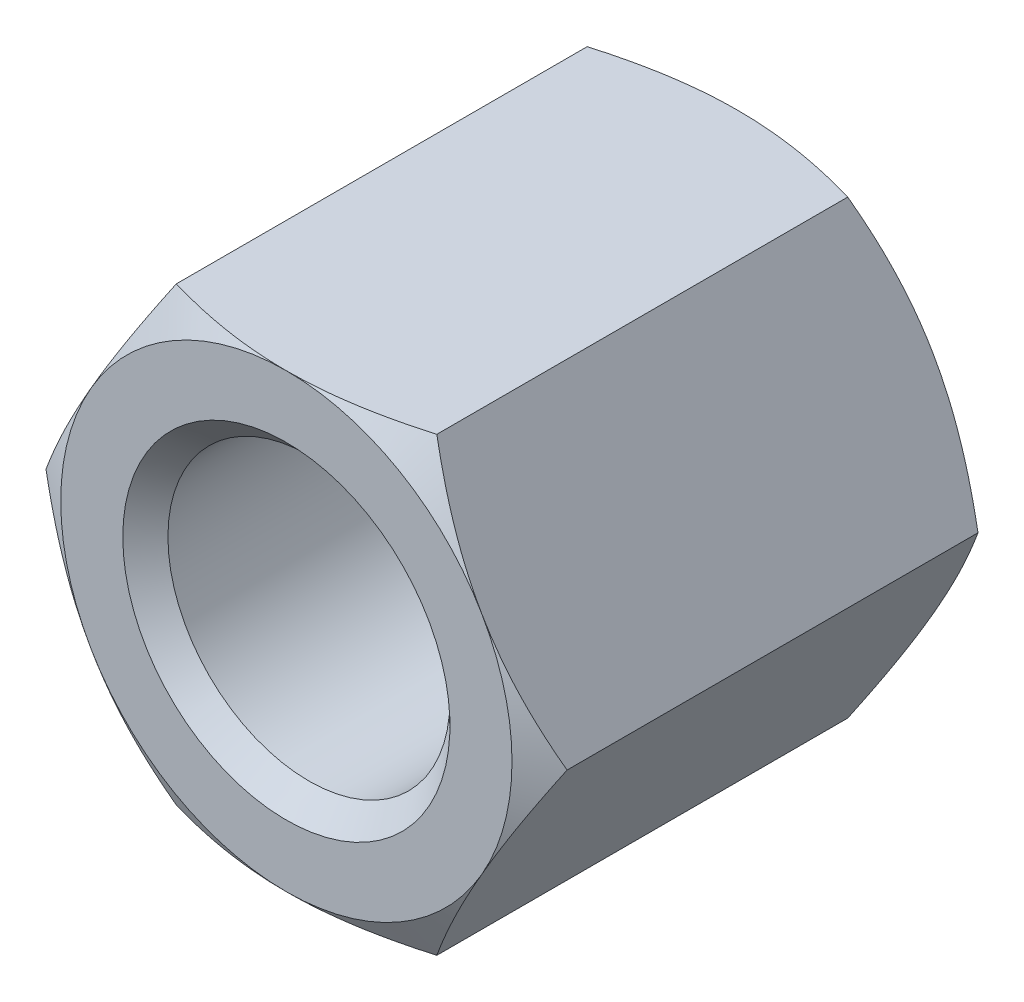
ISO-10303-21;
HEADER;
FILE_DESCRIPTION(('STEP AP214'),'2;1');
FILE_NAME('part.step','',(''),(''),'','','');
FILE_SCHEMA(('AUTOMOTIVE_DESIGN { 1 0 10303 214 1 1 1 1 }'));
ENDSEC;
DATA;
#1=APPLICATION_CONTEXT('core data for automotive mechanical design processes');
#2=APPLICATION_PROTOCOL_DEFINITION('international standard','automotive_design',2000,#1);
#3=PRODUCT_CONTEXT('',#1,'mechanical');
#4=PRODUCT('Part','Part','',(#3));
#5=PRODUCT_RELATED_PRODUCT_CATEGORY('part','',(#4));
#6=PRODUCT_DEFINITION_FORMATION('','',#4);
#7=PRODUCT_DEFINITION_CONTEXT('part definition',#1,'design');
#8=PRODUCT_DEFINITION('design','',#6,#7);
#9=PRODUCT_DEFINITION_SHAPE('','',#8);
#10=(LENGTH_UNIT() NAMED_UNIT(*) SI_UNIT(.MILLI.,.METRE.));
#11=(NAMED_UNIT(*) PLANE_ANGLE_UNIT() SI_UNIT($,.RADIAN.));
#12=(NAMED_UNIT(*) SI_UNIT($,.STERADIAN.) SOLID_ANGLE_UNIT());
#13=UNCERTAINTY_MEASURE_WITH_UNIT(LENGTH_MEASURE(1.E-05),#10,'distance_accuracy_value','');
#14=(GEOMETRIC_REPRESENTATION_CONTEXT(3) GLOBAL_UNCERTAINTY_ASSIGNED_CONTEXT((#13)) GLOBAL_UNIT_ASSIGNED_CONTEXT((#10,
#11,#12)) REPRESENTATION_CONTEXT('',''));
#15=CARTESIAN_POINT('',(0.,0.,0.));
#16=DIRECTION('',(0.,0.,1.));
#17=DIRECTION('',(1.,0.,0.));
#18=AXIS2_PLACEMENT_3D('',#15,#16,#17);
#19=CARTESIAN_POINT('',(4.61880215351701,0.,-4.));
#20=DIRECTION('',(0.866025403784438,0.5,0.));
#21=DIRECTION('',(-0.5,0.866025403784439,0.));
#22=AXIS2_PLACEMENT_3D('',#19,#20,#21);
#23=PLANE('',#22);
#24=CARTESIAN_POINT('',(4.61891762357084,-0.000199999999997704,3.64266774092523));
#25=CARTESIAN_POINT('',(4.51743148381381,0.17557915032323,3.70128212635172));
#26=CARTESIAN_POINT('',(4.41506932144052,0.352875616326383,3.75458967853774));
#27=CARTESIAN_POINT('',(4.20857250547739,0.710538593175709,3.8476383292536));
#28=CARTESIAN_POINT('',(4.10443418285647,0.890911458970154,3.8873465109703));
#29=CARTESIAN_POINT('',(3.89744813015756,1.24942181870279,3.94915778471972));
#30=CARTESIAN_POINT('',(3.79463224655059,1.42750415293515,3.97167226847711));
#31=CARTESIAN_POINT('',(3.58851671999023,1.78450671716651,3.99854937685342));
#32=CARTESIAN_POINT('',(3.48521782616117,1.9634256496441,4.00293425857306));
#33=CARTESIAN_POINT('',(3.29219970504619,2.29774284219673,3.99380992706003));
#34=CARTESIAN_POINT('',(3.20245157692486,2.45319115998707,3.98254104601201));
#35=CARTESIAN_POINT('',(3.02354002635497,2.76307505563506,3.94682600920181));
#36=CARTESIAN_POINT('',(2.93437722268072,2.91750956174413,3.92236765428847));
#37=CARTESIAN_POINT('',(2.75509682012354,3.22803232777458,3.86122393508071));
#38=CARTESIAN_POINT('',(2.6650019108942,3.3840812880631,3.82427939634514));
#39=CARTESIAN_POINT('',(2.48615580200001,3.69385183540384,3.74042992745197));
#40=CARTESIAN_POINT('',(2.39740231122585,3.84757739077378,3.69354469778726));
#41=CARTESIAN_POINT('',(2.30928560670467,4.0002,3.64266774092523));
#42=B_SPLINE_CURVE_WITH_KNOTS('',3,(#24,#25,#26,#27,#28,#29,#30,#31,#32,#33,#34,#35,#36,#37,#38,
#39,#40,#41),.UNSPECIFIED.,.F.,.F.,(4,2,2,2,2,2,2,2,4),(0.,0.634047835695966,1.26961969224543,
1.88946157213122,2.50854226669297,3.04757825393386,3.58711366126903,4.13861653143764,
4.68903648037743),.UNSPECIFIED.);
#43=CARTESIAN_POINT('',(4.61880215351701,0.,3.64273441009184));
#44=VERTEX_POINT('',#43);
#45=CARTESIAN_POINT('',(3.46410161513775,2.,4.));
#46=VERTEX_POINT('',#45);
#47=EDGE_CURVE('E127',#44,#46,#42,.T.);
#48=ORIENTED_EDGE('',*,*,#47,.F.);
#49=DIRECTION('',(0.,0.,1.));
#50=VECTOR('',#49,1.);
#51=CARTESIAN_POINT('',(4.61880215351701,0.,-4.));
#52=LINE('',#51,#50);
#53=CARTESIAN_POINT('',(4.61880215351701,0.,-3.64273441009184));
#54=VERTEX_POINT('',#53);
#55=EDGE_CURVE('E536',#54,#44,#52,.T.);
#56=ORIENTED_EDGE('',*,*,#55,.F.);
#57=CARTESIAN_POINT('',(4.61891762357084,-0.000199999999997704,-3.64266774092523));
#58=CARTESIAN_POINT('',(4.51743148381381,0.17557915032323,-3.70128212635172));
#59=CARTESIAN_POINT('',(4.41506932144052,0.352875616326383,-3.75458967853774));
#60=CARTESIAN_POINT('',(4.20857250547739,0.710538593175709,-3.8476383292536));
#61=CARTESIAN_POINT('',(4.10443418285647,0.890911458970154,-3.8873465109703));
#62=CARTESIAN_POINT('',(3.89744813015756,1.24942181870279,-3.94915778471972));
#63=CARTESIAN_POINT('',(3.79463224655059,1.42750415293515,-3.97167226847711));
#64=CARTESIAN_POINT('',(3.58851671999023,1.78450671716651,-3.99854937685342));
#65=CARTESIAN_POINT('',(3.48521782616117,1.9634256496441,-4.00293425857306));
#66=CARTESIAN_POINT('',(3.29219970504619,2.29774284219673,-3.99380992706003));
#67=CARTESIAN_POINT('',(3.20245157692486,2.45319115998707,-3.98254104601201));
#68=CARTESIAN_POINT('',(3.02354002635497,2.76307505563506,-3.94682600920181));
#69=CARTESIAN_POINT('',(2.93437722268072,2.91750956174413,-3.92236765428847));
#70=CARTESIAN_POINT('',(2.75509682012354,3.22803232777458,-3.86122393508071));
#71=CARTESIAN_POINT('',(2.6650019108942,3.3840812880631,-3.82427939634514));
#72=CARTESIAN_POINT('',(2.48615580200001,3.69385183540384,-3.74042992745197));
#73=CARTESIAN_POINT('',(2.39740231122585,3.84757739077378,-3.69354469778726));
#74=CARTESIAN_POINT('',(2.30928560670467,4.0002,-3.64266774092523));
#75=B_SPLINE_CURVE_WITH_KNOTS('',3,(#57,#58,#59,#60,#61,#62,#63,#64,#65,#66,#67,#68,#69,#70,#71,
#72,#73,#74),.UNSPECIFIED.,.F.,.F.,(4,2,2,2,2,2,2,2,4),(0.,0.634047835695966,1.26961969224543,
1.88946157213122,2.50854226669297,3.04757825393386,3.58711366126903,4.13861653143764,
4.68903648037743),.UNSPECIFIED.);
#76=CARTESIAN_POINT('',(3.46410161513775,2.,-4.));
#77=VERTEX_POINT('',#76);
#78=EDGE_CURVE('E540',#54,#77,#75,.T.);
#79=ORIENTED_EDGE('',*,*,#78,.T.);
#80=CARTESIAN_POINT('',(2.3094010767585,4.,-3.64273441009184));
#81=VERTEX_POINT('',#80);
#82=EDGE_CURVE('E269',#77,#81,#75,.T.);
#83=ORIENTED_EDGE('',*,*,#82,.T.);
#84=DIRECTION('',(0.,0.,1.));
#85=VECTOR('',#84,1.);
#86=CARTESIAN_POINT('',(2.3094010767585,4.,-4.));
#87=LINE('',#86,#85);
#88=CARTESIAN_POINT('',(2.3094010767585,4.,3.64273441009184));
#89=VERTEX_POINT('',#88);
#90=EDGE_CURVE('E159',#81,#89,#87,.T.);
#91=ORIENTED_EDGE('',*,*,#90,.T.);
#92=EDGE_CURVE('E140',#46,#89,#42,.T.);
#93=ORIENTED_EDGE('',*,*,#92,.F.);
#94=EDGE_LOOP('',(#48,#56,#79,#83,#91,#93));
#95=FACE_BOUND('',#94,.T.);
#96=ADVANCED_FACE('F41',(#95),#23,.T.);
#97=CARTESIAN_POINT('',(2.3094010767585,-4.,-4.));
#98=DIRECTION('',(0.866025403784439,-0.5,0.));
#99=DIRECTION('',(0.5,0.866025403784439,0.));
#100=AXIS2_PLACEMENT_3D('',#97,#98,#99);
#101=PLANE('',#100);
#102=CARTESIAN_POINT('',(2.30928560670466,-4.0002,3.64266774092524));
#103=CARTESIAN_POINT('',(2.4107717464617,-3.82442084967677,3.70128212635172));
#104=CARTESIAN_POINT('',(2.51313390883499,-3.64712438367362,3.75458967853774));
#105=CARTESIAN_POINT('',(2.71963072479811,-3.28946140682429,3.8476383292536));
#106=CARTESIAN_POINT('',(2.82376904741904,-3.10908854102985,3.8873465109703));
#107=CARTESIAN_POINT('',(3.03075510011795,-2.75057818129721,3.94915778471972));
#108=CARTESIAN_POINT('',(3.13357098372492,-2.57249584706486,3.97167226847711));
#109=CARTESIAN_POINT('',(3.33968651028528,-2.21549328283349,3.99854937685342));
#110=CARTESIAN_POINT('',(3.44298540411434,-2.0365743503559,4.00293425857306));
#111=CARTESIAN_POINT('',(3.63600352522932,-1.70225715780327,3.99380992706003));
#112=CARTESIAN_POINT('',(3.72575165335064,-1.54680884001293,3.98254104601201));
#113=CARTESIAN_POINT('',(3.90466320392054,-1.23692494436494,3.94682600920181));
#114=CARTESIAN_POINT('',(3.99382600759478,-1.08249043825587,3.92236765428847));
#115=CARTESIAN_POINT('',(4.17310641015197,-0.77196767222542,3.86122393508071));
#116=CARTESIAN_POINT('',(4.26320131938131,-0.615918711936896,3.82427939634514));
#117=CARTESIAN_POINT('',(4.4420474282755,-0.306148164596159,3.74042992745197));
#118=CARTESIAN_POINT('',(4.53080091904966,-0.152422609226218,3.69354469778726));
#119=CARTESIAN_POINT('',(4.61891762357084,0.000200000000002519,3.64266774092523));
#120=B_SPLINE_CURVE_WITH_KNOTS('',3,(#102,#103,#104,#105,#106,#107,#108,#109,#110,#111,#112,
#113,#114,#115,#116,#117,#118,#119),.UNSPECIFIED.,.F.,.F.,(4,2,2,2,2,2,2,2,4),(0.,
0.634047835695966,1.26961969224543,1.88946157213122,2.50854226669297,3.04757825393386,
3.58711366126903,4.13861653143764,4.68903648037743),.UNSPECIFIED.);
#121=CARTESIAN_POINT('',(2.3094010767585,-4.,3.64273441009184));
#122=VERTEX_POINT('',#121);
#123=CARTESIAN_POINT('',(3.46410161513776,-2.,4.));
#124=VERTEX_POINT('',#123);
#125=EDGE_CURVE('E620',#122,#124,#120,.T.);
#126=ORIENTED_EDGE('',*,*,#125,.F.);
#127=DIRECTION('',(0.,0.,1.));
#128=VECTOR('',#127,1.);
#129=CARTESIAN_POINT('',(2.3094010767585,-4.,-4.));
#130=LINE('',#129,#128);
#131=CARTESIAN_POINT('',(2.3094010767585,-4.,-3.64273441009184));
#132=VERTEX_POINT('',#131);
#133=EDGE_CURVE('E283',#132,#122,#130,.T.);
#134=ORIENTED_EDGE('',*,*,#133,.F.);
#135=CARTESIAN_POINT('',(2.30928560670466,-4.0002,-3.64266774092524));
#136=CARTESIAN_POINT('',(2.4107717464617,-3.82442084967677,-3.70128212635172));
#137=CARTESIAN_POINT('',(2.51313390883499,-3.64712438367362,-3.75458967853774));
#138=CARTESIAN_POINT('',(2.71963072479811,-3.28946140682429,-3.8476383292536));
#139=CARTESIAN_POINT('',(2.82376904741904,-3.10908854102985,-3.8873465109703));
#140=CARTESIAN_POINT('',(3.03075510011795,-2.75057818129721,-3.94915778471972));
#141=CARTESIAN_POINT('',(3.13357098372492,-2.57249584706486,-3.97167226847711));
#142=CARTESIAN_POINT('',(3.33968651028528,-2.21549328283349,-3.99854937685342));
#143=CARTESIAN_POINT('',(3.44298540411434,-2.0365743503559,-4.00293425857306));
#144=CARTESIAN_POINT('',(3.63600352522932,-1.70225715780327,-3.99380992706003));
#145=CARTESIAN_POINT('',(3.72575165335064,-1.54680884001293,-3.98254104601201));
#146=CARTESIAN_POINT('',(3.90466320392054,-1.23692494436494,-3.94682600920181));
#147=CARTESIAN_POINT('',(3.99382600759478,-1.08249043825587,-3.92236765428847));
#148=CARTESIAN_POINT('',(4.17310641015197,-0.77196767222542,-3.86122393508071));
#149=CARTESIAN_POINT('',(4.26320131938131,-0.615918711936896,-3.82427939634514));
#150=CARTESIAN_POINT('',(4.4420474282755,-0.306148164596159,-3.74042992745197));
#151=CARTESIAN_POINT('',(4.53080091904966,-0.152422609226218,-3.69354469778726));
#152=CARTESIAN_POINT('',(4.61891762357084,0.000200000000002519,-3.64266774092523));
#153=B_SPLINE_CURVE_WITH_KNOTS('',3,(#135,#136,#137,#138,#139,#140,#141,#142,#143,#144,#145,
#146,#147,#148,#149,#150,#151,#152),.UNSPECIFIED.,.F.,.F.,(4,2,2,2,2,2,2,2,4),(0.,
0.634047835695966,1.26961969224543,1.88946157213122,2.50854226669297,3.04757825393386,
3.58711366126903,4.13861653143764,4.68903648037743),.UNSPECIFIED.);
#154=CARTESIAN_POINT('',(3.46410161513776,-2.,-4.));
#155=VERTEX_POINT('',#154);
#156=EDGE_CURVE('E531',#132,#155,#153,.T.);
#157=ORIENTED_EDGE('',*,*,#156,.T.);
#158=EDGE_CURVE('E284',#155,#54,#153,.T.);
#159=ORIENTED_EDGE('',*,*,#158,.T.);
#160=ORIENTED_EDGE('',*,*,#55,.T.);
#161=EDGE_CURVE('E132',#124,#44,#120,.T.);
#162=ORIENTED_EDGE('',*,*,#161,.F.);
#163=EDGE_LOOP('',(#126,#134,#157,#159,#160,#162));
#164=FACE_BOUND('',#163,.T.);
#165=ADVANCED_FACE('F254',(#164),#101,.T.);
#166=CARTESIAN_POINT('',(-2.3094010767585,-4.,-4.));
#167=DIRECTION('',(0.,-1.,0.));
#168=DIRECTION('',(0.,0.,-1.));
#169=AXIS2_PLACEMENT_3D('',#166,#167,#168);
#170=PLANE('',#169);
#171=CARTESIAN_POINT('',(-10.3272416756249,-4.,-0.0846565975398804));
#172=CARTESIAN_POINT('',(-10.0952248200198,-4.,0.0402445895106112));
#173=CARTESIAN_POINT('',(-9.86298689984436,-4.,0.164737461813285));
#174=CARTESIAN_POINT('',(-9.39795503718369,-4.,0.412693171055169));
#175=CARTESIAN_POINT('',(-9.16516108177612,-4.,0.536155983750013));
#176=CARTESIAN_POINT('',(-8.69870294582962,-4.,0.781943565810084));
#177=CARTESIAN_POINT('',(-8.4650381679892,-4.,0.904267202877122));
#178=CARTESIAN_POINT('',(-7.99690353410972,-4.,1.14736054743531));
#179=CARTESIAN_POINT('',(-7.76243368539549,-4.,1.26813026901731));
#180=CARTESIAN_POINT('',(-7.28303052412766,-4.,1.51254922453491));
#181=CARTESIAN_POINT('',(-7.03805631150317,-4.,1.63611838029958));
#182=CARTESIAN_POINT('',(-6.546756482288,-4.,1.88053862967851));
#183=CARTESIAN_POINT('',(-6.30043088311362,-4.,2.00138975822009));
#184=CARTESIAN_POINT('',(-5.80614229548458,-4.,2.23948277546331));
#185=CARTESIAN_POINT('',(-5.5581799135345,-4.,2.35672591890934));
#186=CARTESIAN_POINT('',(-5.06005452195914,-4.,2.58642419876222));
#187=CARTESIAN_POINT('',(-4.8098916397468,-4.,2.69887961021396));
#188=CARTESIAN_POINT('',(-4.29225066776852,-4.,2.92352120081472));
#189=CARTESIAN_POINT('',(-4.02460342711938,-4.,3.03532081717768));
#190=CARTESIAN_POINT('',(-3.48505640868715,-4.,3.24852564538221));
#191=CARTESIAN_POINT('',(-3.21315544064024,-4.,3.34992788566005));
#192=CARTESIAN_POINT('',(-2.66734138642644,-4.,3.53650312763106));
#193=CARTESIAN_POINT('',(-2.39349038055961,-4.,3.62185429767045));
#194=CARTESIAN_POINT('',(-1.84000359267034,-4.,3.77129092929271));
#195=CARTESIAN_POINT('',(-1.56037126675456,-4.,3.83538872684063));
#196=CARTESIAN_POINT('',(-1.05863581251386,-4.,3.92352628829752));
#197=CARTESIAN_POINT('',(-0.83757344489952,-4.,3.95330528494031));
#198=CARTESIAN_POINT('',(-0.50468970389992,-4.,3.98255673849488));
#199=CARTESIAN_POINT('',(-0.393519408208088,-4.,3.98973774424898));
#200=CARTESIAN_POINT('',(-0.17095539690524,-4.,3.99877889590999));
#201=CARTESIAN_POINT('',(-0.0595616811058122,-4.,4.00063903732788));
#202=CARTESIAN_POINT('',(0.163317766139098,-4.,3.9989725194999));
#203=CARTESIAN_POINT('',(0.274803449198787,-4.,3.99543944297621));
#204=CARTESIAN_POINT('',(0.497486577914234,-4.,3.98308858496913));
#205=CARTESIAN_POINT('',(0.608683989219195,-4.,3.97427020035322));
#206=CARTESIAN_POINT('',(0.941507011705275,-4.,3.94023242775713));
#207=CARTESIAN_POINT('',(1.16238246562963,-4.,3.90743021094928));
#208=CARTESIAN_POINT('',(1.6243569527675,-4.,3.82038093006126));
#209=CARTESIAN_POINT('',(1.86507997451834,-4.,3.76420890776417));
#210=CARTESIAN_POINT('',(2.34232752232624,-4.,3.63596386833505));
#211=CARTESIAN_POINT('',(2.57884899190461,-4.,3.56387974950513));
#212=CARTESIAN_POINT('',(3.04857229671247,-4.,3.40786210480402));
#213=CARTESIAN_POINT('',(3.28176384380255,-4.,3.32389811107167));
#214=CARTESIAN_POINT('',(3.74481026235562,-4.,3.14747250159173));
#215=CARTESIAN_POINT('',(3.9746659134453,-4.,3.05501290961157));
#216=CARTESIAN_POINT('',(4.43512281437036,-4.,2.86243262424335));
#217=CARTESIAN_POINT('',(4.66568486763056,-4.,2.76221889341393));
#218=CARTESIAN_POINT('',(5.12467251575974,-4.,2.55701483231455));
#219=CARTESIAN_POINT('',(5.3530980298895,-4.,2.45202432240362));
#220=CARTESIAN_POINT('',(5.80791052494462,-4.,2.23859788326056));
#221=CARTESIAN_POINT('',(6.03430004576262,-4.,2.13016734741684));
#222=CARTESIAN_POINT('',(6.48572587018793,-4.,1.91054160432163));
#223=CARTESIAN_POINT('',(6.71076219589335,-4.,1.79934644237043));
#224=CARTESIAN_POINT('',(7.22341926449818,-4.,1.54295522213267));
#225=CARTESIAN_POINT('',(7.51068971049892,-4.,1.39705973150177));
#226=CARTESIAN_POINT('',(8.0838665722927,-4.,1.10261555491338));
#227=CARTESIAN_POINT('',(8.36977297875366,-4.,0.954066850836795));
#228=CARTESIAN_POINT('',(8.93476833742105,-4.,0.657962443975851));
#229=CARTESIAN_POINT('',(9.21387849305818,-4.,0.510447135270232));
#230=CARTESIAN_POINT('',(9.77117650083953,-4.,0.213926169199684));
#231=CARTESIAN_POINT('',(10.0493646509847,-4.,0.0649210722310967));
#232=CARTESIAN_POINT('',(10.3272416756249,-4.,-0.0846565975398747));
#233=B_SPLINE_CURVE_WITH_KNOTS('',3,(#171,#172,#173,#174,#175,#176,#177,#178,#179,#180,#181,
#182,#183,#184,#185,#186,#187,#188,#189,#190,#191,#192,#193,#194,#195,#196,#197,#198,#199,#200,
#201,#202,#203,#204,#205,#206,#207,#208,#209,#210,#211,#212,#213,#214,#215,#216,#217,#218,#219,
#220,#221,#222,#223,#224,#225,#226,#227,#228,#229,#230,#231,#232),.UNSPECIFIED.,.F.,.F.,(4,2,2,
2,2,2,2,2,2,2,2,2,2,2,2,2,2,2,2,2,2,2,2,2,2,2,2,2,2,2,4),(0.,0.790500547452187,1.58101964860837,
2.37225489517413,3.16348296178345,3.98659539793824,4.80969725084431,5.63250954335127,
6.45527450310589,7.32530331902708,8.19558009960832,9.05553837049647,9.91499662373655,
10.5832580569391,10.9173530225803,11.2514482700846,11.5859413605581,11.9204726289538,
12.5894782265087,13.3303418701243,14.0717240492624,14.8150433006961,15.5581859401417,
16.3123128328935,17.0664681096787,17.8194943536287,18.5725082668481,19.5390746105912,
20.505647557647,21.4527268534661,22.399462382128),.UNSPECIFIED.);
#234=CARTESIAN_POINT('',(-2.3094010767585,-4.,3.64273441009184));
#235=VERTEX_POINT('',#234);
#236=CARTESIAN_POINT('',(0.,-4.,4.));
#237=VERTEX_POINT('',#236);
#238=EDGE_CURVE('E616',#235,#237,#233,.T.);
#239=ORIENTED_EDGE('',*,*,#238,.F.);
#240=DIRECTION('',(0.,0.,1.));
#241=VECTOR('',#240,1.);
#242=CARTESIAN_POINT('',(-2.3094010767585,-4.,-4.));
#243=LINE('',#242,#241);
#244=CARTESIAN_POINT('',(-2.3094010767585,-4.,-3.64273441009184));
#245=VERTEX_POINT('',#244);
#246=EDGE_CURVE('E527',#245,#235,#243,.T.);
#247=ORIENTED_EDGE('',*,*,#246,.F.);
#248=CARTESIAN_POINT('',(-8.22377281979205,-4.,-1.02955135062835));
#249=CARTESIAN_POINT('',(-8.03223273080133,-4.,-1.1289846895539));
#250=CARTESIAN_POINT('',(-7.84042918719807,-4.,-1.22791473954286));
#251=CARTESIAN_POINT('',(-7.45617172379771,-4.,-1.42451061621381));
#252=CARTESIAN_POINT('',(-7.26371779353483,-4.,-1.5221764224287));
#253=CARTESIAN_POINT('',(-6.87773759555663,-4.,-1.71613603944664));
#254=CARTESIAN_POINT('',(-6.68421011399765,-4.,-1.81242743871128));
#255=CARTESIAN_POINT('',(-6.29622349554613,-4.,-2.00312424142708));
#256=CARTESIAN_POINT('',(-6.10176434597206,-4.,-2.09752961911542));
#257=CARTESIAN_POINT('',(-5.70090690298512,-4.,-2.2891604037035));
#258=CARTESIAN_POINT('',(-5.4944444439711,-4.,-2.38625194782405));
#259=CARTESIAN_POINT('',(-5.07998278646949,-4.,-2.57708350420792));
#260=CARTESIAN_POINT('',(-4.87198365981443,-4.,-2.67082367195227));
#261=CARTESIAN_POINT('',(-4.45421086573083,-4.,-2.85389868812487));
#262=CARTESIAN_POINT('',(-4.24443846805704,-4.,-2.94323641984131));
#263=CARTESIAN_POINT('',(-3.82248793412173,-4.,-3.11621359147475));
#264=CARTESIAN_POINT('',(-3.6103092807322,-4.,-3.1998517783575));
#265=CARTESIAN_POINT('',(-3.15575008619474,-4.,-3.36973257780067));
#266=CARTESIAN_POINT('',(-2.91297839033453,-4.,-3.45493951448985));
#267=CARTESIAN_POINT('',(-2.42312281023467,-4.,-3.6118667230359));
#268=CARTESIAN_POINT('',(-2.17604109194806,-4.,-3.68359356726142));
#269=CARTESIAN_POINT('',(-1.80441100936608,-4.,-3.77669459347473));
#270=CARTESIAN_POINT('',(-1.681618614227,-4.,-3.80509564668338));
#271=CARTESIAN_POINT('',(-1.43495449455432,-4.,-3.8567912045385));
#272=CARTESIAN_POINT('',(-1.31108279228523,-4.,-3.88008581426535));
#273=CARTESIAN_POINT('',(-1.06244370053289,-4.,-3.920915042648));
#274=CARTESIAN_POINT('',(-0.937676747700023,-4.,-3.93845229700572));
#275=CARTESIAN_POINT('',(-0.687419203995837,-4.,-3.9672144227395));
#276=CARTESIAN_POINT('',(-0.561928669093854,-4.,-3.97843977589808));
#277=CARTESIAN_POINT('',(-0.308549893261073,-4.,-3.99429847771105));
#278=CARTESIAN_POINT('',(-0.180654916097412,-4.,-3.99882567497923));
#279=CARTESIAN_POINT('',(0.075188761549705,-4.,-4.00077297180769));
#280=CARTESIAN_POINT('',(0.203137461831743,-4.,-3.9981930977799));
#281=CARTESIAN_POINT('',(0.458726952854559,-4.,-3.98602656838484));
#282=CARTESIAN_POINT('',(0.586367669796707,-4.,-3.976438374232));
#283=CARTESIAN_POINT('',(0.8409657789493,-4.,-3.95062349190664));
#284=CARTESIAN_POINT('',(0.967923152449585,-4.,-3.93439662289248));
#285=CARTESIAN_POINT('',(1.35268609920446,-4.,-3.87576128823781));
#286=CARTESIAN_POINT('',(1.60904019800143,-4.,-3.82368727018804));
#287=CARTESIAN_POINT('',(2.11687147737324,-4.,-3.69994012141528));
#288=CARTESIAN_POINT('',(2.36834661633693,-4.,-3.628258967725));
#289=CARTESIAN_POINT('',(2.86970046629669,-4.,-3.46976028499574));
#290=CARTESIAN_POINT('',(3.11952445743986,-4.,-3.38277258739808));
#291=CARTESIAN_POINT('',(3.61534009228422,-4.,-3.19841412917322));
#292=CARTESIAN_POINT('',(3.86133054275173,-4.,-3.10104020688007));
#293=CARTESIAN_POINT('',(4.35053173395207,-4.,-2.89873175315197));
#294=CARTESIAN_POINT('',(4.5937384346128,-4.,-2.79378753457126));
#295=CARTESIAN_POINT('',(5.07769199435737,-4.,-2.57848518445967));
#296=CARTESIAN_POINT('',(5.31843916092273,-4.,-2.46812773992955));
#297=CARTESIAN_POINT('',(5.78333399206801,-4.,-2.25026747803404));
#298=CARTESIAN_POINT('',(6.00759448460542,-4.,-2.14300441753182));
#299=CARTESIAN_POINT('',(6.45478798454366,-4.,-1.92572996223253));
#300=CARTESIAN_POINT('',(6.67772093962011,-4.,-1.815718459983));
#301=CARTESIAN_POINT('',(7.12167554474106,-4.,-1.59396966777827));
#302=CARTESIAN_POINT('',(7.34270123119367,-4.,-1.48224044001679));
#303=CARTESIAN_POINT('',(7.78385646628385,-4.,-1.25707542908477));
#304=CARTESIAN_POINT('',(8.00398609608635,-4.,-1.14363980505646));
#305=CARTESIAN_POINT('',(8.22377281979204,-4.,-1.02955135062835));
#306=B_SPLINE_CURVE_WITH_KNOTS('',3,(#248,#249,#250,#251,#252,#253,#254,#255,#256,#257,#258,
#259,#260,#261,#262,#263,#264,#265,#266,#267,#268,#269,#270,#271,#272,#273,#274,#275,#276,#277,
#278,#279,#280,#281,#282,#283,#284,#285,#286,#287,#288,#289,#290,#291,#292,#293,#294,#295,#296,
#297,#298,#299,#300,#301,#302,#303,#304,#305),.UNSPECIFIED.,.F.,.F.,(4,2,2,2,2,2,2,2,2,2,2,2,2,
2,2,2,2,2,2,2,2,2,2,2,2,2,2,2,4),(0.,0.647436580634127,1.29488362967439,1.94335363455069,
2.59183249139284,3.27626652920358,3.96066877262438,4.64461665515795,5.32871442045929,
6.10032991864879,6.87156822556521,7.24958208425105,7.62758816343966,8.00542095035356,
8.38322489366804,8.76695437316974,9.15068242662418,9.53449475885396,9.91831754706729,
10.7019388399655,11.4858812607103,12.2791640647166,13.072689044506,13.867248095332,
14.6617065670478,15.4074605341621,16.1532437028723,16.8962174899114,17.6391224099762),.UNSPECIFIED.);
#307=CARTESIAN_POINT('',(0.,-4.,-4.));
#308=VERTEX_POINT('',#307);
#309=EDGE_CURVE('E576',#245,#308,#306,.T.);
#310=ORIENTED_EDGE('',*,*,#309,.T.);
#311=EDGE_CURVE('E259',#308,#132,#306,.T.);
#312=ORIENTED_EDGE('',*,*,#311,.T.);
#313=ORIENTED_EDGE('',*,*,#133,.T.);
#314=EDGE_CURVE('E138',#237,#122,#233,.T.);
#315=ORIENTED_EDGE('',*,*,#314,.F.);
#316=EDGE_LOOP('',(#239,#247,#310,#312,#313,#315));
#317=FACE_BOUND('',#316,.T.);
#318=ADVANCED_FACE('F292',(#317),#170,.T.);
#319=CARTESIAN_POINT('',(-4.61880215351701,0.,-4.));
#320=DIRECTION('',(-0.866025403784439,-0.5,0.));
#321=DIRECTION('',(0.5,-0.866025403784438,0.));
#322=AXIS2_PLACEMENT_3D('',#319,#320,#321);
#323=PLANE('',#322);
#324=CARTESIAN_POINT('',(-4.61891762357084,0.000200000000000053,3.64266774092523));
#325=CARTESIAN_POINT('',(-4.51743148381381,-0.175579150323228,3.70128212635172));
#326=CARTESIAN_POINT('',(-4.41506932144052,-0.352875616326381,3.75458967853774));
#327=CARTESIAN_POINT('',(-4.20857250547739,-0.710538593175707,3.8476383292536));
#328=CARTESIAN_POINT('',(-4.10443418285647,-0.890911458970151,3.8873465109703));
#329=CARTESIAN_POINT('',(-3.89744813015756,-1.24942181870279,3.94915778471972));
#330=CARTESIAN_POINT('',(-3.79463224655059,-1.42750415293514,3.97167226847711));
#331=CARTESIAN_POINT('',(-3.58851671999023,-1.78450671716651,3.99854937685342));
#332=CARTESIAN_POINT('',(-3.48521782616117,-1.9634256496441,4.00293425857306));
#333=CARTESIAN_POINT('',(-3.29219970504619,-2.29774284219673,3.99380992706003));
#334=CARTESIAN_POINT('',(-3.20245157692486,-2.45319115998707,3.98254104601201));
#335=CARTESIAN_POINT('',(-3.02354002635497,-2.76307505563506,3.94682600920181));
#336=CARTESIAN_POINT('',(-2.93437722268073,-2.91750956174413,3.92236765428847));
#337=CARTESIAN_POINT('',(-2.75509682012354,-3.22803232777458,3.86122393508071));
#338=CARTESIAN_POINT('',(-2.6650019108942,-3.3840812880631,3.82427939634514));
#339=CARTESIAN_POINT('',(-2.48615580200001,-3.69385183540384,3.74042992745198));
#340=CARTESIAN_POINT('',(-2.39740231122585,-3.84757739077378,3.69354469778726));
#341=CARTESIAN_POINT('',(-2.30928560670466,-4.0002,3.64266774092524));
#342=B_SPLINE_CURVE_WITH_KNOTS('',3,(#324,#325,#326,#327,#328,#329,#330,#331,#332,#333,#334,
#335,#336,#337,#338,#339,#340,#341),.UNSPECIFIED.,.F.,.F.,(4,2,2,2,2,2,2,2,4),(0.,
0.634047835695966,1.26961969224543,1.88946157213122,2.50854226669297,3.04757825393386,
3.58711366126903,4.13861653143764,4.68903648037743),.UNSPECIFIED.);
#343=CARTESIAN_POINT('',(-4.61880215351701,0.,3.64273441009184));
#344=VERTEX_POINT('',#343);
#345=CARTESIAN_POINT('',(-3.46410161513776,-2.,4.));
#346=VERTEX_POINT('',#345);
#347=EDGE_CURVE('E176',#344,#346,#342,.T.);
#348=ORIENTED_EDGE('',*,*,#347,.F.);
#349=DIRECTION('',(0.,0.,1.));
#350=VECTOR('',#349,1.);
#351=CARTESIAN_POINT('',(-4.61880215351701,0.,-4.));
#352=LINE('',#351,#350);
#353=CARTESIAN_POINT('',(-4.61880215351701,0.,-3.64273441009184));
#354=VERTEX_POINT('',#353);
#355=EDGE_CURVE('E589',#354,#344,#352,.T.);
#356=ORIENTED_EDGE('',*,*,#355,.F.);
#357=CARTESIAN_POINT('',(-4.61891762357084,0.000200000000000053,-3.64266774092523));
#358=CARTESIAN_POINT('',(-4.51743148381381,-0.175579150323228,-3.70128212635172));
#359=CARTESIAN_POINT('',(-4.41506932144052,-0.352875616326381,-3.75458967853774));
#360=CARTESIAN_POINT('',(-4.20857250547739,-0.710538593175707,-3.8476383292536));
#361=CARTESIAN_POINT('',(-4.10443418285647,-0.890911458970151,-3.8873465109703));
#362=CARTESIAN_POINT('',(-3.89744813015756,-1.24942181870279,-3.94915778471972));
#363=CARTESIAN_POINT('',(-3.79463224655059,-1.42750415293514,-3.97167226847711));
#364=CARTESIAN_POINT('',(-3.58851671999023,-1.78450671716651,-3.99854937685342));
#365=CARTESIAN_POINT('',(-3.48521782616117,-1.9634256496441,-4.00293425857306));
#366=CARTESIAN_POINT('',(-3.29219970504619,-2.29774284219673,-3.99380992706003));
#367=CARTESIAN_POINT('',(-3.20245157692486,-2.45319115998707,-3.98254104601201));
#368=CARTESIAN_POINT('',(-3.02354002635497,-2.76307505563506,-3.94682600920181));
#369=CARTESIAN_POINT('',(-2.93437722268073,-2.91750956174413,-3.92236765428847));
#370=CARTESIAN_POINT('',(-2.75509682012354,-3.22803232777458,-3.86122393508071));
#371=CARTESIAN_POINT('',(-2.6650019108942,-3.3840812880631,-3.82427939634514));
#372=CARTESIAN_POINT('',(-2.48615580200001,-3.69385183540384,-3.74042992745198));
#373=CARTESIAN_POINT('',(-2.39740231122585,-3.84757739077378,-3.69354469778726));
#374=CARTESIAN_POINT('',(-2.30928560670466,-4.0002,-3.64266774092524));
#375=B_SPLINE_CURVE_WITH_KNOTS('',3,(#357,#358,#359,#360,#361,#362,#363,#364,#365,#366,#367,
#368,#369,#370,#371,#372,#373,#374),.UNSPECIFIED.,.F.,.F.,(4,2,2,2,2,2,2,2,4),(0.,
0.634047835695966,1.26961969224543,1.88946157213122,2.50854226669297,3.04757825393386,
3.58711366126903,4.13861653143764,4.68903648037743),.UNSPECIFIED.);
#376=CARTESIAN_POINT('',(-3.46410161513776,-2.,-4.));
#377=VERTEX_POINT('',#376);
#378=EDGE_CURVE('E275',#354,#377,#375,.T.);
#379=ORIENTED_EDGE('',*,*,#378,.T.);
#380=EDGE_CURVE('E282',#377,#245,#375,.T.);
#381=ORIENTED_EDGE('',*,*,#380,.T.);
#382=ORIENTED_EDGE('',*,*,#246,.T.);
#383=EDGE_CURVE('E613',#346,#235,#342,.T.);
#384=ORIENTED_EDGE('',*,*,#383,.F.);
#385=EDGE_LOOP('',(#348,#356,#379,#381,#382,#384));
#386=FACE_BOUND('',#385,.T.);
#387=ADVANCED_FACE('F289',(#386),#323,.T.);
#388=CARTESIAN_POINT('',(-2.3094010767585,4.,-4.));
#389=DIRECTION('',(-0.866025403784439,0.5,0.));
#390=DIRECTION('',(-0.5,-0.866025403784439,0.));
#391=AXIS2_PLACEMENT_3D('',#388,#389,#390);
#392=PLANE('',#391);
#393=CARTESIAN_POINT('',(-2.30928560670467,4.0002,3.64266774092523));
#394=CARTESIAN_POINT('',(-2.41077174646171,3.82442084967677,3.70128212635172));
#395=CARTESIAN_POINT('',(-2.51313390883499,3.64712438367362,3.75458967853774));
#396=CARTESIAN_POINT('',(-2.71963072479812,3.28946140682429,3.8476383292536));
#397=CARTESIAN_POINT('',(-2.82376904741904,3.10908854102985,3.8873465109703));
#398=CARTESIAN_POINT('',(-3.03075510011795,2.75057818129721,3.94915778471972));
#399=CARTESIAN_POINT('',(-3.13357098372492,2.57249584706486,3.97167226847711));
#400=CARTESIAN_POINT('',(-3.33968651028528,2.21549328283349,3.99854937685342));
#401=CARTESIAN_POINT('',(-3.44298540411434,2.0365743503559,4.00293425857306));
#402=CARTESIAN_POINT('',(-3.63600352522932,1.70225715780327,3.99380992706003));
#403=CARTESIAN_POINT('',(-3.72575165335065,1.54680884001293,3.98254104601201));
#404=CARTESIAN_POINT('',(-3.90466320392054,1.23692494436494,3.94682600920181));
#405=CARTESIAN_POINT('',(-3.99382600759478,1.08249043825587,3.92236765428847));
#406=CARTESIAN_POINT('',(-4.17310641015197,0.771967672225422,3.86122393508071));
#407=CARTESIAN_POINT('',(-4.26320131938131,0.615918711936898,3.82427939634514));
#408=CARTESIAN_POINT('',(-4.4420474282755,0.30614816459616,3.74042992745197));
#409=CARTESIAN_POINT('',(-4.53080091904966,0.15242260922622,3.69354469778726));
#410=CARTESIAN_POINT('',(-4.61891762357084,-0.000200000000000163,3.64266774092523));
#411=B_SPLINE_CURVE_WITH_KNOTS('',3,(#393,#394,#395,#396,#397,#398,#399,#400,#401,#402,#403,
#404,#405,#406,#407,#408,#409,#410),.UNSPECIFIED.,.F.,.F.,(4,2,2,2,2,2,2,2,4),(0.,
0.634047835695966,1.26961969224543,1.88946157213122,2.50854226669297,3.04757825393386,
3.58711366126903,4.13861653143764,4.68903648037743),.UNSPECIFIED.);
#412=CARTESIAN_POINT('',(-2.3094010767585,4.,3.64273441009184));
#413=VERTEX_POINT('',#412);
#414=CARTESIAN_POINT('',(-3.46410161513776,2.,4.));
#415=VERTEX_POINT('',#414);
#416=EDGE_CURVE('E183',#413,#415,#411,.T.);
#417=ORIENTED_EDGE('',*,*,#416,.F.);
#418=DIRECTION('',(0.,0.,1.));
#419=VECTOR('',#418,1.);
#420=CARTESIAN_POINT('',(-2.3094010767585,4.,-4.));
#421=LINE('',#420,#419);
#422=CARTESIAN_POINT('',(-2.3094010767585,4.,-3.64273441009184));
#423=VERTEX_POINT('',#422);
#424=EDGE_CURVE('E233',#423,#413,#421,.T.);
#425=ORIENTED_EDGE('',*,*,#424,.F.);
#426=CARTESIAN_POINT('',(-2.30928560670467,4.0002,-3.64266774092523));
#427=CARTESIAN_POINT('',(-2.41077174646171,3.82442084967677,-3.70128212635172));
#428=CARTESIAN_POINT('',(-2.51313390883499,3.64712438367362,-3.75458967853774));
#429=CARTESIAN_POINT('',(-2.71963072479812,3.28946140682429,-3.8476383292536));
#430=CARTESIAN_POINT('',(-2.82376904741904,3.10908854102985,-3.8873465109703));
#431=CARTESIAN_POINT('',(-3.03075510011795,2.75057818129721,-3.94915778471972));
#432=CARTESIAN_POINT('',(-3.13357098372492,2.57249584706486,-3.97167226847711));
#433=CARTESIAN_POINT('',(-3.33968651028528,2.21549328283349,-3.99854937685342));
#434=CARTESIAN_POINT('',(-3.44298540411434,2.0365743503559,-4.00293425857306));
#435=CARTESIAN_POINT('',(-3.63600352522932,1.70225715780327,-3.99380992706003));
#436=CARTESIAN_POINT('',(-3.72575165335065,1.54680884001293,-3.98254104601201));
#437=CARTESIAN_POINT('',(-3.90466320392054,1.23692494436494,-3.94682600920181));
#438=CARTESIAN_POINT('',(-3.99382600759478,1.08249043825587,-3.92236765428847));
#439=CARTESIAN_POINT('',(-4.17310641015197,0.771967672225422,-3.86122393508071));
#440=CARTESIAN_POINT('',(-4.26320131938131,0.615918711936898,-3.82427939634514));
#441=CARTESIAN_POINT('',(-4.4420474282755,0.306148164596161,-3.74042992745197));
#442=CARTESIAN_POINT('',(-4.53080091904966,0.152422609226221,-3.69354469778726));
#443=CARTESIAN_POINT('',(-4.61891762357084,-0.00019999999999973,-3.64266774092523));
#444=B_SPLINE_CURVE_WITH_KNOTS('',3,(#426,#427,#428,#429,#430,#431,#432,#433,#434,#435,#436,
#437,#438,#439,#440,#441,#442,#443),.UNSPECIFIED.,.F.,.F.,(4,2,2,2,2,2,2,2,4),(0.,
0.634047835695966,1.26961969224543,1.88946157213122,2.50854226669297,3.04757825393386,
3.58711366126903,4.13861653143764,4.68903648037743),.UNSPECIFIED.);
#445=CARTESIAN_POINT('',(-3.46410161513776,2.,-4.));
#446=VERTEX_POINT('',#445);
#447=EDGE_CURVE('E237',#423,#446,#444,.T.);
#448=ORIENTED_EDGE('',*,*,#447,.T.);
#449=EDGE_CURVE('E591',#446,#354,#444,.T.);
#450=ORIENTED_EDGE('',*,*,#449,.T.);
#451=ORIENTED_EDGE('',*,*,#355,.T.);
#452=EDGE_CURVE('E605',#415,#344,#411,.T.);
#453=ORIENTED_EDGE('',*,*,#452,.F.);
#454=EDGE_LOOP('',(#417,#425,#448,#450,#451,#453));
#455=FACE_BOUND('',#454,.T.);
#456=ADVANCED_FACE('F218',(#455),#392,.T.);
#457=CARTESIAN_POINT('',(2.3094010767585,4.,-4.));
#458=DIRECTION('',(0.,1.,0.));
#459=DIRECTION('',(0.,0.,1.));
#460=AXIS2_PLACEMENT_3D('',#457,#458,#459);
#461=PLANE('',#460);
#462=CARTESIAN_POINT('',(10.3272416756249,4.,-0.0846565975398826));
#463=CARTESIAN_POINT('',(10.0952248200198,4.,0.040244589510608));
#464=CARTESIAN_POINT('',(9.86298689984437,4.,0.164737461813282));
#465=CARTESIAN_POINT('',(9.39795503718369,4.,0.412693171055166));
#466=CARTESIAN_POINT('',(9.16516108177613,4.,0.536155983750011));
#467=CARTESIAN_POINT('',(8.69870294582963,4.,0.781943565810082));
#468=CARTESIAN_POINT('',(8.4650381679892,4.,0.904267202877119));
#469=CARTESIAN_POINT('',(7.99690353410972,4.,1.14736054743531));
#470=CARTESIAN_POINT('',(7.76243368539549,4.,1.2681302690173));
#471=CARTESIAN_POINT('',(7.28303052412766,4.,1.5125492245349));
#472=CARTESIAN_POINT('',(7.03805631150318,4.,1.63611838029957));
#473=CARTESIAN_POINT('',(6.546756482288,4.,1.8805386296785));
#474=CARTESIAN_POINT('',(6.30043088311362,4.,2.00138975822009));
#475=CARTESIAN_POINT('',(5.80614229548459,4.,2.23948277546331));
#476=CARTESIAN_POINT('',(5.55817991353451,4.,2.35672591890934));
#477=CARTESIAN_POINT('',(5.06005452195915,4.,2.58642419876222));
#478=CARTESIAN_POINT('',(4.8098916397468,4.,2.69887961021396));
#479=CARTESIAN_POINT('',(4.29225066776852,4.,2.92352120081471));
#480=CARTESIAN_POINT('',(4.02460342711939,4.,3.03532081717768));
#481=CARTESIAN_POINT('',(3.48505640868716,4.,3.2485256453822));
#482=CARTESIAN_POINT('',(3.21315544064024,4.,3.34992788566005));
#483=CARTESIAN_POINT('',(2.66734138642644,4.,3.53650312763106));
#484=CARTESIAN_POINT('',(2.39349038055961,4.,3.62185429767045));
#485=CARTESIAN_POINT('',(1.84000359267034,4.,3.77129092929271));
#486=CARTESIAN_POINT('',(1.56037126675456,4.,3.83538872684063));
#487=CARTESIAN_POINT('',(1.05863581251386,4.,3.92352628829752));
#488=CARTESIAN_POINT('',(0.837573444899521,4.,3.95330528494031));
#489=CARTESIAN_POINT('',(0.50468970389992,4.,3.98255673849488));
#490=CARTESIAN_POINT('',(0.393519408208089,4.,3.98973774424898));
#491=CARTESIAN_POINT('',(0.170955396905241,4.,3.99877889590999));
#492=CARTESIAN_POINT('',(0.0595616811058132,4.,4.00063903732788));
#493=CARTESIAN_POINT('',(-0.163317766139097,4.,3.9989725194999));
#494=CARTESIAN_POINT('',(-0.274803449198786,4.,3.99543944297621));
#495=CARTESIAN_POINT('',(-0.497486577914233,4.,3.98308858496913));
#496=CARTESIAN_POINT('',(-0.608683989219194,4.,3.97427020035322));
#497=CARTESIAN_POINT('',(-0.941507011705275,4.,3.94023242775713));
#498=CARTESIAN_POINT('',(-1.16238246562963,4.,3.90743021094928));
#499=CARTESIAN_POINT('',(-1.6243569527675,4.,3.82038093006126));
#500=CARTESIAN_POINT('',(-1.86507997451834,4.,3.76420890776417));
#501=CARTESIAN_POINT('',(-2.34232752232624,4.,3.63596386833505));
#502=CARTESIAN_POINT('',(-2.57884899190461,4.,3.56387974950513));
#503=CARTESIAN_POINT('',(-3.04857229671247,4.,3.40786210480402));
#504=CARTESIAN_POINT('',(-3.28176384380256,4.,3.32389811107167));
#505=CARTESIAN_POINT('',(-3.74481026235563,4.,3.14747250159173));
#506=CARTESIAN_POINT('',(-3.97466591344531,4.,3.05501290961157));
#507=CARTESIAN_POINT('',(-4.43512281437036,4.,2.86243262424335));
#508=CARTESIAN_POINT('',(-4.66568486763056,4.,2.76221889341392));
#509=CARTESIAN_POINT('',(-5.12467251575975,4.,2.55701483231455));
#510=CARTESIAN_POINT('',(-5.35309802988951,4.,2.45202432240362));
#511=CARTESIAN_POINT('',(-5.80791052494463,4.,2.23859788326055));
#512=CARTESIAN_POINT('',(-6.03430004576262,4.,2.13016734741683));
#513=CARTESIAN_POINT('',(-6.48572587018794,4.,1.91054160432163));
#514=CARTESIAN_POINT('',(-6.71076219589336,4.,1.79934644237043));
#515=CARTESIAN_POINT('',(-7.22341926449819,4.,1.54295522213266));
#516=CARTESIAN_POINT('',(-7.51068971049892,4.,1.39705973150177));
#517=CARTESIAN_POINT('',(-8.0838665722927,4.,1.10261555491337));
#518=CARTESIAN_POINT('',(-8.36977297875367,4.,0.954066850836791));
#519=CARTESIAN_POINT('',(-8.93476833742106,4.,0.657962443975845));
#520=CARTESIAN_POINT('',(-9.2138784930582,4.,0.510447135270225));
#521=CARTESIAN_POINT('',(-9.77117650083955,4.,0.213926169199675));
#522=CARTESIAN_POINT('',(-10.0493646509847,4.,0.0649210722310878));
#523=CARTESIAN_POINT('',(-10.3272416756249,4.,-0.0846565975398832));
#524=B_SPLINE_CURVE_WITH_KNOTS('',3,(#462,#463,#464,#465,#466,#467,#468,#469,#470,#471,#472,
#473,#474,#475,#476,#477,#478,#479,#480,#481,#482,#483,#484,#485,#486,#487,#488,#489,#490,#491,
#492,#493,#494,#495,#496,#497,#498,#499,#500,#501,#502,#503,#504,#505,#506,#507,#508,#509,#510,
#511,#512,#513,#514,#515,#516,#517,#518,#519,#520,#521,#522,#523),.UNSPECIFIED.,.F.,.F.,(4,2,2,
2,2,2,2,2,2,2,2,2,2,2,2,2,2,2,2,2,2,2,2,2,2,2,2,2,2,2,4),(0.,0.790500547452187,1.58101964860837,
2.37225489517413,3.16348296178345,3.98659539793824,4.80969725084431,5.63250954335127,
6.4552745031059,7.32530331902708,8.19558009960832,9.05553837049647,9.91499662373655,
10.5832580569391,10.9173530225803,11.2514482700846,11.5859413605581,11.9204726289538,
12.5894782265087,13.3303418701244,14.0717240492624,14.8150433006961,15.5581859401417,
16.3123128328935,17.0664681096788,17.8194943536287,18.5725082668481,19.5390746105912,
20.505647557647,21.4527268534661,22.399462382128),.UNSPECIFIED.);
#525=CARTESIAN_POINT('',(0.,4.,4.));
#526=VERTEX_POINT('',#525);
#527=EDGE_CURVE('E145',#89,#526,#524,.T.);
#528=ORIENTED_EDGE('',*,*,#527,.F.);
#529=ORIENTED_EDGE('',*,*,#90,.F.);
#530=CARTESIAN_POINT('',(8.22377281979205,4.,-1.02955135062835));
#531=CARTESIAN_POINT('',(8.03223273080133,4.,-1.1289846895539));
#532=CARTESIAN_POINT('',(7.84042918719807,4.,-1.22791473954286));
#533=CARTESIAN_POINT('',(7.45617172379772,4.,-1.42451061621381));
#534=CARTESIAN_POINT('',(7.26371779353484,4.,-1.5221764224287));
#535=CARTESIAN_POINT('',(6.87773759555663,4.,-1.71613603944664));
#536=CARTESIAN_POINT('',(6.68421011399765,4.,-1.81242743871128));
#537=CARTESIAN_POINT('',(6.29622349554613,4.,-2.00312424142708));
#538=CARTESIAN_POINT('',(6.10176434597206,4.,-2.09752961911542));
#539=CARTESIAN_POINT('',(5.70090690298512,4.,-2.2891604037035));
#540=CARTESIAN_POINT('',(5.4944444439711,4.,-2.38625194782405));
#541=CARTESIAN_POINT('',(5.07998278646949,4.,-2.57708350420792));
#542=CARTESIAN_POINT('',(4.87198365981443,4.,-2.67082367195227));
#543=CARTESIAN_POINT('',(4.45421086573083,4.,-2.85389868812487));
#544=CARTESIAN_POINT('',(4.24443846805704,4.,-2.94323641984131));
#545=CARTESIAN_POINT('',(3.82248793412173,4.,-3.11621359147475));
#546=CARTESIAN_POINT('',(3.6103092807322,4.,-3.1998517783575));
#547=CARTESIAN_POINT('',(3.15575008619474,4.,-3.36973257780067));
#548=CARTESIAN_POINT('',(2.91297839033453,4.,-3.45493951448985));
#549=CARTESIAN_POINT('',(2.42312281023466,4.,-3.6118667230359));
#550=CARTESIAN_POINT('',(2.17604109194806,4.,-3.68359356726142));
#551=CARTESIAN_POINT('',(1.80441100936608,4.,-3.77669459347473));
#552=CARTESIAN_POINT('',(1.681618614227,4.,-3.80509564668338));
#553=CARTESIAN_POINT('',(1.43495449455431,4.,-3.8567912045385));
#554=CARTESIAN_POINT('',(1.31108279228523,4.,-3.88008581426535));
#555=CARTESIAN_POINT('',(1.06244370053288,4.,-3.920915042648));
#556=CARTESIAN_POINT('',(0.93767674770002,4.,-3.93845229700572));
#557=CARTESIAN_POINT('',(0.687419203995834,4.,-3.9672144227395));
#558=CARTESIAN_POINT('',(0.561928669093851,4.,-3.97843977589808));
#559=CARTESIAN_POINT('',(0.30854989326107,4.,-3.99429847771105));
#560=CARTESIAN_POINT('',(0.180654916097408,4.,-3.99882567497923));
#561=CARTESIAN_POINT('',(-0.0751887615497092,4.,-4.00077297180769));
#562=CARTESIAN_POINT('',(-0.203137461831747,4.,-3.9981930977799));
#563=CARTESIAN_POINT('',(-0.458726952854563,4.,-3.98602656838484));
#564=CARTESIAN_POINT('',(-0.58636766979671,4.,-3.976438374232));
#565=CARTESIAN_POINT('',(-0.840965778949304,4.,-3.95062349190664));
#566=CARTESIAN_POINT('',(-0.967923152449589,4.,-3.93439662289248));
#567=CARTESIAN_POINT('',(-1.35268609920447,4.,-3.87576128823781));
#568=CARTESIAN_POINT('',(-1.60904019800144,4.,-3.82368727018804));
#569=CARTESIAN_POINT('',(-2.11687147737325,4.,-3.69994012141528));
#570=CARTESIAN_POINT('',(-2.36834661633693,4.,-3.628258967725));
#571=CARTESIAN_POINT('',(-2.8697004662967,4.,-3.46976028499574));
#572=CARTESIAN_POINT('',(-3.11952445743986,4.,-3.38277258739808));
#573=CARTESIAN_POINT('',(-3.61534009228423,4.,-3.19841412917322));
#574=CARTESIAN_POINT('',(-3.86133054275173,4.,-3.10104020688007));
#575=CARTESIAN_POINT('',(-4.35053173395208,4.,-2.89873175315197));
#576=CARTESIAN_POINT('',(-4.5937384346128,4.,-2.79378753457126));
#577=CARTESIAN_POINT('',(-5.07769199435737,4.,-2.57848518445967));
#578=CARTESIAN_POINT('',(-5.31843916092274,4.,-2.46812773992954));
#579=CARTESIAN_POINT('',(-5.78333399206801,4.,-2.25026747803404));
#580=CARTESIAN_POINT('',(-6.00759448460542,4.,-2.14300441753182));
#581=CARTESIAN_POINT('',(-6.45478798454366,4.,-1.92572996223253));
#582=CARTESIAN_POINT('',(-6.67772093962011,4.,-1.815718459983));
#583=CARTESIAN_POINT('',(-7.12167554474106,4.,-1.59396966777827));
#584=CARTESIAN_POINT('',(-7.34270123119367,4.,-1.48224044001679));
#585=CARTESIAN_POINT('',(-7.78385646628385,4.,-1.25707542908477));
#586=CARTESIAN_POINT('',(-8.00398609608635,4.,-1.14363980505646));
#587=CARTESIAN_POINT('',(-8.22377281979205,4.,-1.02955135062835));
#588=B_SPLINE_CURVE_WITH_KNOTS('',3,(#530,#531,#532,#533,#534,#535,#536,#537,#538,#539,#540,
#541,#542,#543,#544,#545,#546,#547,#548,#549,#550,#551,#552,#553,#554,#555,#556,#557,#558,#559,
#560,#561,#562,#563,#564,#565,#566,#567,#568,#569,#570,#571,#572,#573,#574,#575,#576,#577,#578,
#579,#580,#581,#582,#583,#584,#585,#586,#587),.UNSPECIFIED.,.F.,.F.,(4,2,2,2,2,2,2,2,2,2,2,2,2,
2,2,2,2,2,2,2,2,2,2,2,2,2,2,2,4),(0.,0.647436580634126,1.29488362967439,1.94335363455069,
2.59183249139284,3.27626652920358,3.96066877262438,4.64461665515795,5.32871442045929,
6.10032991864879,6.87156822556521,7.24958208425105,7.62758816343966,8.00542095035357,
8.38322489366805,8.76695437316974,9.15068242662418,9.53449475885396,9.91831754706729,
10.7019388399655,11.4858812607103,12.2791640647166,13.072689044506,13.867248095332,
14.6617065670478,15.4074605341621,16.1532437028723,16.8962174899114,17.6391224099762),.UNSPECIFIED.);
#589=CARTESIAN_POINT('',(0.,4.,-4.));
#590=VERTEX_POINT('',#589);
#591=EDGE_CURVE('E234',#81,#590,#588,.T.);
#592=ORIENTED_EDGE('',*,*,#591,.T.);
#593=EDGE_CURVE('E223',#590,#423,#588,.T.);
#594=ORIENTED_EDGE('',*,*,#593,.T.);
#595=ORIENTED_EDGE('',*,*,#424,.T.);
#596=EDGE_CURVE('E161',#526,#413,#524,.T.);
#597=ORIENTED_EDGE('',*,*,#596,.F.);
#598=EDGE_LOOP('',(#528,#529,#592,#594,#595,#597));
#599=FACE_BOUND('',#598,.T.);
#600=ADVANCED_FACE('F214',(#599),#461,.T.);
#601=CARTESIAN_POINT('',(0.,0.,-4.));
#602=DIRECTION('',(0.,0.,1.));
#603=DIRECTION('',(-1.,0.,0.));
#604=AXIS2_PLACEMENT_3D('',#601,#602,#603);
#605=CONICAL_SURFACE('',#604,4.,1.0471975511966);
#606=CARTESIAN_POINT('',(0.,0.,-4.));
#607=DIRECTION('',(0.,0.,1.));
#608=DIRECTION('',(1.,0.,0.));
#609=AXIS2_PLACEMENT_3D('',#606,#607,#608);
#610=CIRCLE('',#609,4.);
#611=EDGE_CURVE('E543',#155,#77,#610,.T.);
#612=ORIENTED_EDGE('',*,*,#611,.T.);
#613=ORIENTED_EDGE('',*,*,#78,.F.);
#614=ORIENTED_EDGE('',*,*,#158,.F.);
#615=EDGE_LOOP('',(#612,#613,#614));
#616=FACE_BOUND('',#615,.T.);
#617=ADVANCED_FACE('F217',(#616),#605,.T.);
#618=EDGE_CURVE('E546',#308,#155,#610,.T.);
#619=ORIENTED_EDGE('',*,*,#618,.T.);
#620=ORIENTED_EDGE('',*,*,#156,.F.);
#621=ORIENTED_EDGE('',*,*,#311,.F.);
#622=EDGE_LOOP('',(#619,#620,#621));
#623=FACE_BOUND('',#622,.T.);
#624=ADVANCED_FACE('F337',(#623),#605,.T.);
#625=ORIENTED_EDGE('',*,*,#380,.F.);
#626=EDGE_CURVE('E554',#377,#308,#610,.T.);
#627=ORIENTED_EDGE('',*,*,#626,.T.);
#628=ORIENTED_EDGE('',*,*,#309,.F.);
#629=EDGE_LOOP('',(#625,#627,#628));
#630=FACE_BOUND('',#629,.T.);
#631=ADVANCED_FACE('F251',(#630),#605,.T.);
#632=ORIENTED_EDGE('',*,*,#449,.F.);
#633=EDGE_CURVE('E559',#446,#377,#610,.T.);
#634=ORIENTED_EDGE('',*,*,#633,.T.);
#635=ORIENTED_EDGE('',*,*,#378,.F.);
#636=EDGE_LOOP('',(#632,#634,#635));
#637=FACE_BOUND('',#636,.T.);
#638=ADVANCED_FACE('F249',(#637),#605,.T.);
#639=ORIENTED_EDGE('',*,*,#593,.F.);
#640=CARTESIAN_POINT('',(0.,0.,-4.));
#641=DIRECTION('',(0.,0.,-1.));
#642=DIRECTION('',(-1.,0.,0.));
#643=AXIS2_PLACEMENT_3D('',#640,#641,#642);
#644=CIRCLE('',#643,4.);
#645=EDGE_CURVE('E235',#446,#590,#644,.T.);
#646=ORIENTED_EDGE('',*,*,#645,.F.);
#647=ORIENTED_EDGE('',*,*,#447,.F.);
#648=EDGE_LOOP('',(#639,#646,#647));
#649=FACE_BOUND('',#648,.T.);
#650=ADVANCED_FACE('F243',(#649),#605,.T.);
#651=EDGE_CURVE('E547',#77,#590,#610,.T.);
#652=ORIENTED_EDGE('',*,*,#651,.T.);
#653=ORIENTED_EDGE('',*,*,#591,.F.);
#654=ORIENTED_EDGE('',*,*,#82,.F.);
#655=EDGE_LOOP('',(#652,#653,#654));
#656=FACE_BOUND('',#655,.T.);
#657=ADVANCED_FACE('F248',(#656),#605,.T.);
#658=CARTESIAN_POINT('',(0.,0.,-4.));
#659=DIRECTION('',(0.,0.,1.));
#660=DIRECTION('',(1.,0.,0.));
#661=AXIS2_PLACEMENT_3D('',#658,#659,#660);
#662=PLANE('',#661);
#663=CARTESIAN_POINT('',(0.,0.,-4.));
#664=DIRECTION('',(0.,0.,1.));
#665=DIRECTION('',(1.,0.,0.));
#666=AXIS2_PLACEMENT_3D('',#663,#664,#665);
#667=CIRCLE('',#666,2.9);
#668=CARTESIAN_POINT('',(2.9,0.,-4.));
#669=VERTEX_POINT('',#668);
#670=EDGE_CURVE('E558',#669,#669,#667,.T.);
#671=ORIENTED_EDGE('',*,*,#670,.T.);
#672=EDGE_LOOP('',(#671));
#673=FACE_BOUND('',#672,.T.);
#674=ORIENTED_EDGE('',*,*,#651,.F.);
#675=ORIENTED_EDGE('',*,*,#611,.F.);
#676=ORIENTED_EDGE('',*,*,#618,.F.);
#677=ORIENTED_EDGE('',*,*,#626,.F.);
#678=ORIENTED_EDGE('',*,*,#633,.F.);
#679=ORIENTED_EDGE('',*,*,#645,.T.);
#680=EDGE_LOOP('',(#674,#675,#676,#677,#678,#679));
#681=FACE_BOUND('',#680,.T.);
#682=ADVANCED_FACE('F371',(#673,#681),#662,.F.);
#683=CARTESIAN_POINT('',(0.,0.,0.));
#684=DIRECTION('',(0.,0.,-1.));
#685=DIRECTION('',(-1.,0.,0.));
#686=AXIS2_PLACEMENT_3D('',#683,#684,#685);
#687=CYLINDRICAL_SURFACE('',#686,2.5);
#688=CARTESIAN_POINT('',(0.,0.,3.6));
#689=DIRECTION('',(0.,0.,-1.));
#690=DIRECTION('',(-1.,0.,0.));
#691=AXIS2_PLACEMENT_3D('',#688,#689,#690);
#692=CIRCLE('',#691,2.5);
#693=CARTESIAN_POINT('',(-2.5,0.,3.6));
#694=VERTEX_POINT('',#693);
#695=EDGE_CURVE('E12',#694,#694,#692,.F.);
#696=ORIENTED_EDGE('',*,*,#695,.T.);
#697=EDGE_LOOP('',(#696));
#698=FACE_BOUND('',#697,.T.);
#699=CARTESIAN_POINT('',(0.,0.,-3.6));
#700=DIRECTION('',(0.,0.,1.));
#701=DIRECTION('',(1.,0.,0.));
#702=AXIS2_PLACEMENT_3D('',#699,#700,#701);
#703=CIRCLE('',#702,2.5);
#704=CARTESIAN_POINT('',(2.5,0.,-3.6));
#705=VERTEX_POINT('',#704);
#706=EDGE_CURVE('E612',#705,#705,#703,.F.);
#707=ORIENTED_EDGE('',*,*,#706,.T.);
#708=EDGE_LOOP('',(#707));
#709=FACE_BOUND('',#708,.T.);
#710=ADVANCED_FACE('F252',(#698,#709),#687,.F.);
#711=CARTESIAN_POINT('',(0.,0.,-3.6));
#712=DIRECTION('',(0.,0.,-1.));
#713=DIRECTION('',(-1.,0.,0.));
#714=AXIS2_PLACEMENT_3D('',#711,#712,#713);
#715=CONICAL_SURFACE('',#714,2.5,0.785398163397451);
#716=ORIENTED_EDGE('',*,*,#670,.F.);
#717=EDGE_LOOP('',(#716));
#718=FACE_BOUND('',#717,.T.);
#719=ORIENTED_EDGE('',*,*,#706,.F.);
#720=EDGE_LOOP('',(#719));
#721=FACE_BOUND('',#720,.T.);
#722=ADVANCED_FACE('F386',(#718,#721),#715,.F.);
#723=CARTESIAN_POINT('',(0.,0.,4.));
#724=DIRECTION('',(0.,0.,-1.));
#725=DIRECTION('',(-1.,0.,0.));
#726=AXIS2_PLACEMENT_3D('',#723,#724,#725);
#727=CONICAL_SURFACE('',#726,4.,1.0471975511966);
#728=ORIENTED_EDGE('',*,*,#347,.T.);
#729=CARTESIAN_POINT('',(0.,0.,4.));
#730=DIRECTION('',(0.,0.,-1.));
#731=DIRECTION('',(-1.,0.,0.));
#732=AXIS2_PLACEMENT_3D('',#729,#730,#731);
#733=CIRCLE('',#732,4.);
#734=EDGE_CURVE('E149',#415,#346,#733,.F.);
#735=ORIENTED_EDGE('',*,*,#734,.F.);
#736=ORIENTED_EDGE('',*,*,#452,.T.);
#737=EDGE_LOOP('',(#728,#735,#736));
#738=FACE_BOUND('',#737,.T.);
#739=ADVANCED_FACE('F194',(#738),#727,.T.);
#740=ORIENTED_EDGE('',*,*,#416,.T.);
#741=CARTESIAN_POINT('',(0.,0.,4.));
#742=DIRECTION('',(0.,0.,-1.));
#743=DIRECTION('',(-1.,0.,0.));
#744=AXIS2_PLACEMENT_3D('',#741,#742,#743);
#745=CIRCLE('',#744,4.);
#746=EDGE_CURVE('E167',#415,#526,#745,.T.);
#747=ORIENTED_EDGE('',*,*,#746,.T.);
#748=ORIENTED_EDGE('',*,*,#596,.T.);
#749=EDGE_LOOP('',(#740,#747,#748));
#750=FACE_BOUND('',#749,.T.);
#751=ADVANCED_FACE('F191',(#750),#727,.T.);
#752=ORIENTED_EDGE('',*,*,#92,.T.);
#753=ORIENTED_EDGE('',*,*,#527,.T.);
#754=EDGE_CURVE('E59',#46,#526,#733,.F.);
#755=ORIENTED_EDGE('',*,*,#754,.F.);
#756=EDGE_LOOP('',(#752,#753,#755));
#757=FACE_BOUND('',#756,.T.);
#758=ADVANCED_FACE('F143',(#757),#727,.T.);
#759=ORIENTED_EDGE('',*,*,#161,.T.);
#760=ORIENTED_EDGE('',*,*,#47,.T.);
#761=EDGE_CURVE('E129',#124,#46,#733,.F.);
#762=ORIENTED_EDGE('',*,*,#761,.F.);
#763=EDGE_LOOP('',(#759,#760,#762));
#764=FACE_BOUND('',#763,.T.);
#765=ADVANCED_FACE('F128',(#764),#727,.T.);
#766=ORIENTED_EDGE('',*,*,#314,.T.);
#767=ORIENTED_EDGE('',*,*,#125,.T.);
#768=EDGE_CURVE('E154',#237,#124,#733,.F.);
#769=ORIENTED_EDGE('',*,*,#768,.F.);
#770=EDGE_LOOP('',(#766,#767,#769));
#771=FACE_BOUND('',#770,.T.);
#772=ADVANCED_FACE('F420',(#771),#727,.T.);
#773=ORIENTED_EDGE('',*,*,#238,.T.);
#774=EDGE_CURVE('E619',#346,#237,#733,.F.);
#775=ORIENTED_EDGE('',*,*,#774,.F.);
#776=ORIENTED_EDGE('',*,*,#383,.T.);
#777=EDGE_LOOP('',(#773,#775,#776));
#778=FACE_BOUND('',#777,.T.);
#779=ADVANCED_FACE('F196',(#778),#727,.T.);
#780=CARTESIAN_POINT('',(0.,0.,4.));
#781=DIRECTION('',(0.,0.,-1.));
#782=DIRECTION('',(1.,0.,0.));
#783=AXIS2_PLACEMENT_3D('',#780,#781,#782);
#784=PLANE('',#783);
#785=CARTESIAN_POINT('',(0.,0.,4.));
#786=DIRECTION('',(0.,0.,-1.));
#787=DIRECTION('',(-1.,0.,0.));
#788=AXIS2_PLACEMENT_3D('',#785,#786,#787);
#789=CIRCLE('',#788,2.90000000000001);
#790=CARTESIAN_POINT('',(-2.90000000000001,0.,4.));
#791=VERTEX_POINT('',#790);
#792=EDGE_CURVE('E51',#791,#791,#789,.T.);
#793=ORIENTED_EDGE('',*,*,#792,.T.);
#794=EDGE_LOOP('',(#793));
#795=FACE_BOUND('',#794,.T.);
#796=ORIENTED_EDGE('',*,*,#734,.T.);
#797=ORIENTED_EDGE('',*,*,#774,.T.);
#798=ORIENTED_EDGE('',*,*,#768,.T.);
#799=ORIENTED_EDGE('',*,*,#761,.T.);
#800=ORIENTED_EDGE('',*,*,#754,.T.);
#801=ORIENTED_EDGE('',*,*,#746,.F.);
#802=EDGE_LOOP('',(#796,#797,#798,#799,#800,#801));
#803=FACE_BOUND('',#802,.T.);
#804=ADVANCED_FACE('F151',(#795,#803),#784,.F.);
#805=CARTESIAN_POINT('',(0.,0.,4.));
#806=DIRECTION('',(0.,0.,1.));
#807=DIRECTION('',(1.,0.,0.));
#808=AXIS2_PLACEMENT_3D('',#805,#806,#807);
#809=CONICAL_SURFACE('',#808,2.90000000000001,0.785398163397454);
#810=ORIENTED_EDGE('',*,*,#695,.F.);
#811=EDGE_LOOP('',(#810));
#812=FACE_BOUND('',#811,.T.);
#813=ORIENTED_EDGE('',*,*,#792,.F.);
#814=EDGE_LOOP('',(#813));
#815=FACE_BOUND('',#814,.T.);
#816=ADVANCED_FACE('F43',(#812,#815),#809,.F.);
#817=CLOSED_SHELL('',(#96,#165,#318,#387,#456,#600,#617,#624,#631,#638,#650,#657,#682,#710,#722,
#739,#751,#758,#765,#772,#779,#804,#816));
#818=MANIFOLD_SOLID_BREP('B2',#817);
#819=ADVANCED_BREP_SHAPE_REPRESENTATION('',(#18,#818),#14);
#820=SHAPE_DEFINITION_REPRESENTATION(#9,#819);
ENDSEC;
END-ISO-10303-21;
